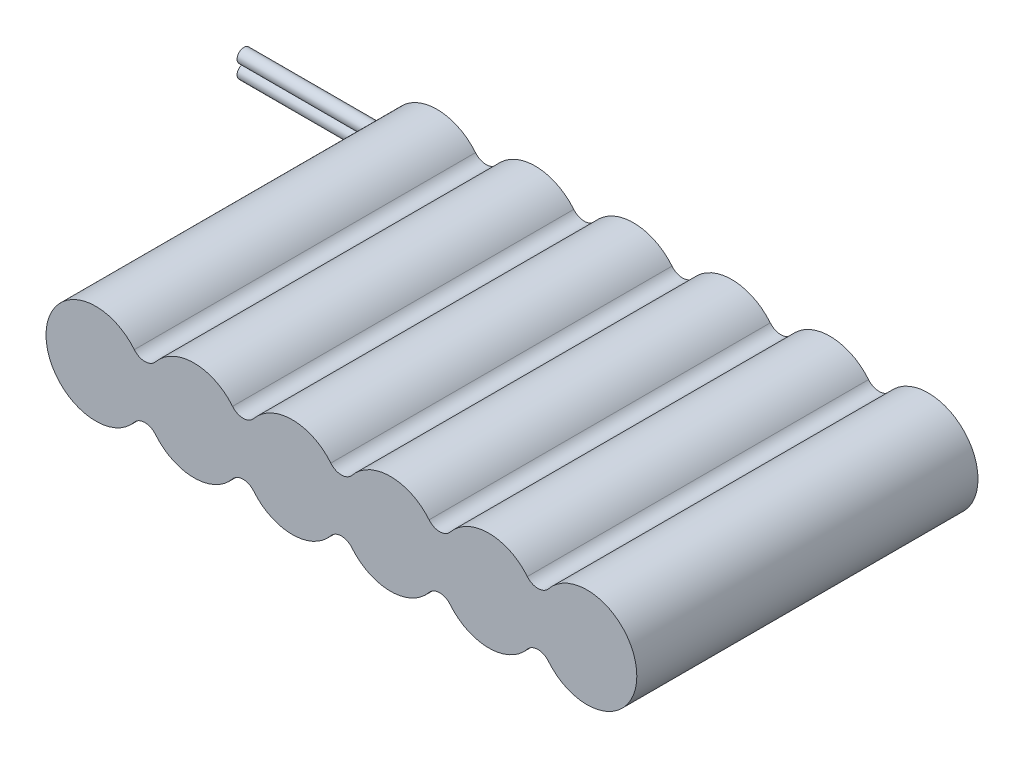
ISO-10303-21;
HEADER;
FILE_DESCRIPTION(('STEP AP214'),'2;1');
FILE_NAME('part.step','',(''),(''),'','','');
FILE_SCHEMA(('AUTOMOTIVE_DESIGN { 1 0 10303 214 1 1 1 1 }'));
ENDSEC;
DATA;
#1=APPLICATION_CONTEXT('core data for automotive mechanical design processes');
#2=APPLICATION_PROTOCOL_DEFINITION('international standard','automotive_design',2000,#1);
#3=PRODUCT_CONTEXT('',#1,'mechanical');
#4=PRODUCT('Part','Part','',(#3));
#5=PRODUCT_RELATED_PRODUCT_CATEGORY('part','',(#4));
#6=PRODUCT_DEFINITION_FORMATION('','',#4);
#7=PRODUCT_DEFINITION_CONTEXT('part definition',#1,'design');
#8=PRODUCT_DEFINITION('design','',#6,#7);
#9=PRODUCT_DEFINITION_SHAPE('','',#8);
#10=(LENGTH_UNIT() NAMED_UNIT(*) SI_UNIT(.MILLI.,.METRE.));
#11=(NAMED_UNIT(*) PLANE_ANGLE_UNIT() SI_UNIT($,.RADIAN.));
#12=(NAMED_UNIT(*) SI_UNIT($,.STERADIAN.) SOLID_ANGLE_UNIT());
#13=UNCERTAINTY_MEASURE_WITH_UNIT(LENGTH_MEASURE(1.E-05),#10,'distance_accuracy_value','');
#14=(GEOMETRIC_REPRESENTATION_CONTEXT(3) GLOBAL_UNCERTAINTY_ASSIGNED_CONTEXT((#13)) GLOBAL_UNIT_ASSIGNED_CONTEXT((#10,
#11,#12)) REPRESENTATION_CONTEXT('',''));
#15=CARTESIAN_POINT('',(0.,0.,0.));
#16=DIRECTION('',(0.,0.,1.));
#17=DIRECTION('',(1.,0.,0.));
#18=AXIS2_PLACEMENT_3D('',#15,#16,#17);
#19=CARTESIAN_POINT('',(-34.6604166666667,-1.27,1.27));
#20=DIRECTION('',(1.,0.,0.));
#21=DIRECTION('',(0.,0.,-1.));
#22=AXIS2_PLACEMENT_3D('',#19,#20,#21);
#23=CYLINDRICAL_SURFACE('',#22,1.27);
#24=CARTESIAN_POINT('',(-9.26041666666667,-1.27,1.27));
#25=DIRECTION('',(-1.,0.,0.));
#26=DIRECTION('',(0.,0.,1.));
#27=AXIS2_PLACEMENT_3D('',#24,#25,#26);
#28=CIRCLE('',#27,1.27);
#29=CARTESIAN_POINT('',(-9.26041666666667,-0.00884622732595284,1.1203632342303));
#30=VERTEX_POINT('',#29);
#31=CARTESIAN_POINT('',(-9.26041666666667,-0.00884622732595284,1.41963676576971));
#32=VERTEX_POINT('',#31);
#33=EDGE_CURVE('E139',#30,#32,#28,.T.);
#34=ORIENTED_EDGE('',*,*,#33,.T.);
#35=DIRECTION('',(1.,0.,0.));
#36=VECTOR('',#35,1.);
#37=CARTESIAN_POINT('',(-34.6604166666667,-0.00884622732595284,1.41963676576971));
#38=LINE('',#37,#36);
#39=CARTESIAN_POINT('',(-34.6604166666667,-0.00884622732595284,1.41963676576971));
#40=VERTEX_POINT('',#39);
#41=EDGE_CURVE('E13',#40,#32,#38,.T.);
#42=ORIENTED_EDGE('',*,*,#41,.F.);
#43=CARTESIAN_POINT('',(-34.6604166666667,-1.27,1.27));
#44=DIRECTION('',(-1.,0.,0.));
#45=DIRECTION('',(0.,0.,1.));
#46=AXIS2_PLACEMENT_3D('',#43,#44,#45);
#47=CIRCLE('',#46,1.27);
#48=CARTESIAN_POINT('',(-34.6604166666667,-0.00884622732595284,1.1203632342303));
#49=VERTEX_POINT('',#48);
#50=EDGE_CURVE('E127',#49,#40,#47,.T.);
#51=ORIENTED_EDGE('',*,*,#50,.F.);
#52=DIRECTION('',(1.,0.,0.));
#53=VECTOR('',#52,1.);
#54=CARTESIAN_POINT('',(-34.6604166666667,-0.00884622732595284,1.1203632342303));
#55=LINE('',#54,#53);
#56=EDGE_CURVE('E135',#49,#30,#55,.T.);
#57=ORIENTED_EDGE('',*,*,#56,.T.);
#58=EDGE_LOOP('',(#34,#42,#51,#57));
#59=FACE_BOUND('',#58,.T.);
#60=ADVANCED_FACE('F76',(#59),#23,.T.);
#61=CARTESIAN_POINT('',(-34.6604166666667,0.00884622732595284,1.41963676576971));
#62=DIRECTION('',(0.,0.,-1.));
#63=DIRECTION('',(-1.,0.,0.));
#64=AXIS2_PLACEMENT_3D('',#61,#62,#63);
#65=PLANE('',#64);
#66=DIRECTION('',(0.,1.,0.));
#67=VECTOR('',#66,1.);
#68=CARTESIAN_POINT('',(-9.26041666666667,0.00884622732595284,1.41963676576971));
#69=LINE('',#68,#67);
#70=CARTESIAN_POINT('',(-9.26041666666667,0.00884622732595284,1.41963676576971));
#71=VERTEX_POINT('',#70);
#72=EDGE_CURVE('E131',#32,#71,#69,.T.);
#73=ORIENTED_EDGE('',*,*,#72,.T.);
#74=DIRECTION('',(1.,0.,0.));
#75=VECTOR('',#74,1.);
#76=CARTESIAN_POINT('',(-34.6604166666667,0.00884622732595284,1.41963676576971));
#77=LINE('',#76,#75);
#78=CARTESIAN_POINT('',(-34.6604166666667,0.00884622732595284,1.41963676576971));
#79=VERTEX_POINT('',#78);
#80=EDGE_CURVE('E84',#79,#71,#77,.T.);
#81=ORIENTED_EDGE('',*,*,#80,.F.);
#82=DIRECTION('',(0.,1.,0.));
#83=VECTOR('',#82,1.);
#84=CARTESIAN_POINT('',(-34.6604166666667,0.00884622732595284,1.41963676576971));
#85=LINE('',#84,#83);
#86=EDGE_CURVE('E122',#40,#79,#85,.T.);
#87=ORIENTED_EDGE('',*,*,#86,.F.);
#88=ORIENTED_EDGE('',*,*,#41,.T.);
#89=EDGE_LOOP('',(#73,#81,#87,#88));
#90=FACE_BOUND('',#89,.T.);
#91=ADVANCED_FACE('F130',(#90),#65,.F.);
#92=CARTESIAN_POINT('',(-34.6604166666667,1.27,1.27));
#93=DIRECTION('',(1.,0.,0.));
#94=DIRECTION('',(0.,0.,-1.));
#95=AXIS2_PLACEMENT_3D('',#92,#93,#94);
#96=CYLINDRICAL_SURFACE('',#95,1.27);
#97=CARTESIAN_POINT('',(-9.26041666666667,1.27,1.27));
#98=DIRECTION('',(-1.,0.,0.));
#99=DIRECTION('',(0.,0.,1.));
#100=AXIS2_PLACEMENT_3D('',#97,#98,#99);
#101=CIRCLE('',#100,1.27);
#102=CARTESIAN_POINT('',(-9.26041666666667,0.00884622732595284,1.12036323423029));
#103=VERTEX_POINT('',#102);
#104=EDGE_CURVE('E109',#71,#103,#101,.T.);
#105=ORIENTED_EDGE('',*,*,#104,.T.);
#106=DIRECTION('',(1.,0.,0.));
#107=VECTOR('',#106,1.);
#108=CARTESIAN_POINT('',(-34.6604166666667,0.00884622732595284,1.12036323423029));
#109=LINE('',#108,#107);
#110=CARTESIAN_POINT('',(-34.6604166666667,0.00884622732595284,1.12036323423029));
#111=VERTEX_POINT('',#110);
#112=EDGE_CURVE('E132',#111,#103,#109,.T.);
#113=ORIENTED_EDGE('',*,*,#112,.F.);
#114=CARTESIAN_POINT('',(-34.6604166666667,1.27,1.27));
#115=DIRECTION('',(-1.,0.,0.));
#116=DIRECTION('',(0.,0.,1.));
#117=AXIS2_PLACEMENT_3D('',#114,#115,#116);
#118=CIRCLE('',#117,1.27);
#119=EDGE_CURVE('E125',#79,#111,#118,.T.);
#120=ORIENTED_EDGE('',*,*,#119,.F.);
#121=ORIENTED_EDGE('',*,*,#80,.T.);
#122=EDGE_LOOP('',(#105,#113,#120,#121));
#123=FACE_BOUND('',#122,.T.);
#124=ADVANCED_FACE('F133',(#123),#96,.T.);
#125=CARTESIAN_POINT('',(-34.6604166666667,0.00884622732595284,1.1203632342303));
#126=DIRECTION('',(0.,0.,1.));
#127=DIRECTION('',(1.,0.,0.));
#128=AXIS2_PLACEMENT_3D('',#125,#126,#127);
#129=PLANE('',#128);
#130=DIRECTION('',(0.,-1.,0.));
#131=VECTOR('',#130,1.);
#132=CARTESIAN_POINT('',(-9.26041666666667,0.00884622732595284,1.1203632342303));
#133=LINE('',#132,#131);
#134=EDGE_CURVE('E115',#103,#30,#133,.T.);
#135=ORIENTED_EDGE('',*,*,#134,.T.);
#136=ORIENTED_EDGE('',*,*,#56,.F.);
#137=DIRECTION('',(0.,-1.,0.));
#138=VECTOR('',#137,1.);
#139=CARTESIAN_POINT('',(-34.6604166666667,0.00884622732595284,1.1203632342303));
#140=LINE('',#139,#138);
#141=EDGE_CURVE('E92',#111,#49,#140,.T.);
#142=ORIENTED_EDGE('',*,*,#141,.F.);
#143=ORIENTED_EDGE('',*,*,#112,.T.);
#144=EDGE_LOOP('',(#135,#136,#142,#143));
#145=FACE_BOUND('',#144,.T.);
#146=ADVANCED_FACE('F146',(#145),#129,.F.);
#147=CARTESIAN_POINT('',(-34.6604166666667,-1.27,1.27));
#148=DIRECTION('',(-1.,0.,0.));
#149=DIRECTION('',(0.,0.,1.));
#150=AXIS2_PLACEMENT_3D('',#147,#148,#149);
#151=PLANE('',#150);
#152=ORIENTED_EDGE('',*,*,#50,.T.);
#153=ORIENTED_EDGE('',*,*,#86,.T.);
#154=ORIENTED_EDGE('',*,*,#119,.T.);
#155=ORIENTED_EDGE('',*,*,#141,.T.);
#156=EDGE_LOOP('',(#152,#153,#154,#155));
#157=FACE_BOUND('',#156,.T.);
#158=ADVANCED_FACE('F123',(#157),#151,.T.);
#159=CARTESIAN_POINT('',(-9.26041666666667,-1.27,1.27));
#160=DIRECTION('',(-1.,0.,0.));
#161=DIRECTION('',(0.,0.,1.));
#162=AXIS2_PLACEMENT_3D('',#159,#160,#161);
#163=PLANE('',#162);
#164=ORIENTED_EDGE('',*,*,#33,.F.);
#165=ORIENTED_EDGE('',*,*,#134,.F.);
#166=ORIENTED_EDGE('',*,*,#104,.F.);
#167=ORIENTED_EDGE('',*,*,#72,.F.);
#168=EDGE_LOOP('',(#164,#165,#166,#167));
#169=FACE_BOUND('',#168,.T.);
#170=ADVANCED_FACE('F149',(#169),#163,.F.);
#171=CLOSED_SHELL('',(#60,#91,#124,#146,#158,#170));
#172=MANIFOLD_SOLID_BREP('B2',#171);
#173=CARTESIAN_POINT('',(91.44,0.,63.5));
#174=DIRECTION('',(0.,0.,-1.));
#175=DIRECTION('',(-1.,0.,0.));
#176=AXIS2_PLACEMENT_3D('',#173,#174,#175);
#177=CYLINDRICAL_SURFACE('',#176,9.26041666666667);
#178=CARTESIAN_POINT('',(91.44,0.,63.5));
#179=DIRECTION('',(0.,0.,1.));
#180=DIRECTION('',(1.,0.,0.));
#181=AXIS2_PLACEMENT_3D('',#178,#179,#180);
#182=CIRCLE('',#181,9.26041666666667);
#183=CARTESIAN_POINT('',(84.2642152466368,-5.85349724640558,63.5));
#184=VERTEX_POINT('',#183);
#185=CARTESIAN_POINT('',(84.2642152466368,5.85349724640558,63.5));
#186=VERTEX_POINT('',#185);
#187=EDGE_CURVE('E350',#184,#186,#182,.T.);
#188=ORIENTED_EDGE('',*,*,#187,.F.);
#189=DIRECTION('',(0.,0.,-1.));
#190=VECTOR('',#189,1.);
#191=CARTESIAN_POINT('',(84.2642152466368,-5.85349724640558,63.5));
#192=LINE('',#191,#190);
#193=CARTESIAN_POINT('',(84.2642152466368,-5.85349724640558,0.));
#194=VERTEX_POINT('',#193);
#195=EDGE_CURVE('E404',#184,#194,#192,.T.);
#196=ORIENTED_EDGE('',*,*,#195,.T.);
#197=CARTESIAN_POINT('',(91.44,0.,0.));
#198=DIRECTION('',(0.,0.,1.));
#199=DIRECTION('',(1.,0.,0.));
#200=AXIS2_PLACEMENT_3D('',#197,#198,#199);
#201=CIRCLE('',#200,9.26041666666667);
#202=CARTESIAN_POINT('',(84.2642152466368,5.85349724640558,0.));
#203=VERTEX_POINT('',#202);
#204=EDGE_CURVE('E398',#194,#203,#201,.T.);
#205=ORIENTED_EDGE('',*,*,#204,.T.);
#206=DIRECTION('',(0.,0.,-1.));
#207=VECTOR('',#206,1.);
#208=CARTESIAN_POINT('',(84.2642152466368,5.85349724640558,63.5));
#209=LINE('',#208,#207);
#210=EDGE_CURVE('E401',#203,#186,#209,.F.);
#211=ORIENTED_EDGE('',*,*,#210,.T.);
#212=EDGE_LOOP('',(#188,#196,#205,#211));
#213=FACE_BOUND('',#212,.T.);
#214=ADVANCED_FACE('F201',(#213),#177,.T.);
#215=CARTESIAN_POINT('',(91.44,0.,0.));
#216=DIRECTION('',(0.,0.,1.));
#217=DIRECTION('',(1.,0.,0.));
#218=AXIS2_PLACEMENT_3D('',#215,#216,#217);
#219=PLANE('',#218);
#220=ORIENTED_EDGE('',*,*,#204,.F.);
#221=CARTESIAN_POINT('',(82.296,-7.45902791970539,0.));
#222=DIRECTION('',(0.,0.,1.));
#223=DIRECTION('',(1.,0.,0.));
#224=AXIS2_PLACEMENT_3D('',#221,#222,#223);
#225=CIRCLE('',#224,2.54);
#226=CARTESIAN_POINT('',(80.3277847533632,-5.85349724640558,0.));
#227=VERTEX_POINT('',#226);
#228=EDGE_CURVE('E358',#194,#227,#225,.T.);
#229=ORIENTED_EDGE('',*,*,#228,.T.);
#230=CARTESIAN_POINT('',(73.152,0.,0.));
#231=DIRECTION('',(0.,0.,1.));
#232=DIRECTION('',(1.,0.,0.));
#233=AXIS2_PLACEMENT_3D('',#230,#231,#232);
#234=CIRCLE('',#233,9.26041666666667);
#235=CARTESIAN_POINT('',(65.9762152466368,-5.85349724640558,0.));
#236=VERTEX_POINT('',#235);
#237=EDGE_CURVE('E343',#236,#227,#234,.T.);
#238=ORIENTED_EDGE('',*,*,#237,.F.);
#239=CARTESIAN_POINT('',(64.008,-7.45902791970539,0.));
#240=DIRECTION('',(0.,0.,1.));
#241=DIRECTION('',(1.,0.,0.));
#242=AXIS2_PLACEMENT_3D('',#239,#240,#241);
#243=CIRCLE('',#242,2.54);
#244=CARTESIAN_POINT('',(62.0397847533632,-5.85349724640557,0.));
#245=VERTEX_POINT('',#244);
#246=EDGE_CURVE('E355',#236,#245,#243,.T.);
#247=ORIENTED_EDGE('',*,*,#246,.T.);
#248=CARTESIAN_POINT('',(54.864,0.,0.));
#249=DIRECTION('',(0.,0.,1.));
#250=DIRECTION('',(1.,0.,0.));
#251=AXIS2_PLACEMENT_3D('',#248,#249,#250);
#252=CIRCLE('',#251,9.26041666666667);
#253=CARTESIAN_POINT('',(47.6882152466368,-5.85349724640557,0.));
#254=VERTEX_POINT('',#253);
#255=EDGE_CURVE('E523',#254,#245,#252,.T.);
#256=ORIENTED_EDGE('',*,*,#255,.F.);
#257=CARTESIAN_POINT('',(45.72,-7.45902791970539,0.));
#258=DIRECTION('',(0.,0.,1.));
#259=DIRECTION('',(1.,0.,0.));
#260=AXIS2_PLACEMENT_3D('',#257,#258,#259);
#261=CIRCLE('',#260,2.54);
#262=CARTESIAN_POINT('',(43.7517847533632,-5.85349724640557,0.));
#263=VERTEX_POINT('',#262);
#264=EDGE_CURVE('E369',#254,#263,#261,.T.);
#265=ORIENTED_EDGE('',*,*,#264,.T.);
#266=CARTESIAN_POINT('',(36.576,0.,0.));
#267=DIRECTION('',(0.,0.,1.));
#268=DIRECTION('',(1.,0.,0.));
#269=AXIS2_PLACEMENT_3D('',#266,#267,#268);
#270=CIRCLE('',#269,9.26041666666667);
#271=CARTESIAN_POINT('',(29.4002152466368,-5.85349724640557,0.));
#272=VERTEX_POINT('',#271);
#273=EDGE_CURVE('E503',#272,#263,#270,.T.);
#274=ORIENTED_EDGE('',*,*,#273,.F.);
#275=CARTESIAN_POINT('',(27.432,-7.45902791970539,0.));
#276=DIRECTION('',(0.,0.,1.));
#277=DIRECTION('',(1.,0.,0.));
#278=AXIS2_PLACEMENT_3D('',#275,#276,#277);
#279=CIRCLE('',#278,2.54);
#280=CARTESIAN_POINT('',(25.4637847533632,-5.85349724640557,0.));
#281=VERTEX_POINT('',#280);
#282=EDGE_CURVE('E377',#272,#281,#279,.T.);
#283=ORIENTED_EDGE('',*,*,#282,.T.);
#284=CARTESIAN_POINT('',(18.288,0.,0.));
#285=DIRECTION('',(0.,0.,1.));
#286=DIRECTION('',(1.,0.,0.));
#287=AXIS2_PLACEMENT_3D('',#284,#285,#286);
#288=CIRCLE('',#287,9.26041666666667);
#289=CARTESIAN_POINT('',(11.1122152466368,-5.85349724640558,0.));
#290=VERTEX_POINT('',#289);
#291=EDGE_CURVE('E536',#290,#281,#288,.T.);
#292=ORIENTED_EDGE('',*,*,#291,.F.);
#293=CARTESIAN_POINT('',(9.144,-7.45902791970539,0.));
#294=DIRECTION('',(0.,0.,1.));
#295=DIRECTION('',(1.,0.,0.));
#296=AXIS2_PLACEMENT_3D('',#293,#294,#295);
#297=CIRCLE('',#296,2.54);
#298=CARTESIAN_POINT('',(7.17578475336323,-5.85349724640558,0.));
#299=VERTEX_POINT('',#298);
#300=EDGE_CURVE('E381',#290,#299,#297,.T.);
#301=ORIENTED_EDGE('',*,*,#300,.T.);
#302=CARTESIAN_POINT('',(0.,0.,0.));
#303=DIRECTION('',(0.,0.,1.));
#304=DIRECTION('',(1.,0.,0.));
#305=AXIS2_PLACEMENT_3D('',#302,#303,#304);
#306=CIRCLE('',#305,9.26041666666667);
#307=CARTESIAN_POINT('',(7.17578475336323,5.85349724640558,0.));
#308=VERTEX_POINT('',#307);
#309=EDGE_CURVE('E542',#308,#299,#306,.T.);
#310=ORIENTED_EDGE('',*,*,#309,.F.);
#311=CARTESIAN_POINT('',(9.144,7.45902791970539,0.));
#312=DIRECTION('',(0.,0.,1.));
#313=DIRECTION('',(1.,0.,0.));
#314=AXIS2_PLACEMENT_3D('',#311,#312,#313);
#315=CIRCLE('',#314,2.54);
#316=CARTESIAN_POINT('',(11.1122152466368,5.85349724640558,0.));
#317=VERTEX_POINT('',#316);
#318=EDGE_CURVE('E383',#308,#317,#315,.T.);
#319=ORIENTED_EDGE('',*,*,#318,.T.);
#320=CARTESIAN_POINT('',(25.4637847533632,5.85349724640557,0.));
#321=VERTEX_POINT('',#320);
#322=EDGE_CURVE('E537',#321,#317,#288,.T.);
#323=ORIENTED_EDGE('',*,*,#322,.F.);
#324=CARTESIAN_POINT('',(27.432,7.45902791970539,0.));
#325=DIRECTION('',(0.,0.,1.));
#326=DIRECTION('',(1.,0.,0.));
#327=AXIS2_PLACEMENT_3D('',#324,#325,#326);
#328=CIRCLE('',#327,2.54);
#329=CARTESIAN_POINT('',(29.4002152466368,5.85349724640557,0.));
#330=VERTEX_POINT('',#329);
#331=EDGE_CURVE('E387',#321,#330,#328,.T.);
#332=ORIENTED_EDGE('',*,*,#331,.T.);
#333=CARTESIAN_POINT('',(43.7517847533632,5.85349724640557,0.));
#334=VERTEX_POINT('',#333);
#335=EDGE_CURVE('E510',#334,#330,#270,.T.);
#336=ORIENTED_EDGE('',*,*,#335,.F.);
#337=CARTESIAN_POINT('',(45.72,7.45902791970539,0.));
#338=DIRECTION('',(0.,0.,1.));
#339=DIRECTION('',(1.,0.,0.));
#340=AXIS2_PLACEMENT_3D('',#337,#338,#339);
#341=CIRCLE('',#340,2.54);
#342=CARTESIAN_POINT('',(47.6882152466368,5.85349724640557,0.));
#343=VERTEX_POINT('',#342);
#344=EDGE_CURVE('E391',#334,#343,#341,.T.);
#345=ORIENTED_EDGE('',*,*,#344,.T.);
#346=CARTESIAN_POINT('',(62.0397847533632,5.85349724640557,0.));
#347=VERTEX_POINT('',#346);
#348=EDGE_CURVE('E526',#347,#343,#252,.T.);
#349=ORIENTED_EDGE('',*,*,#348,.F.);
#350=CARTESIAN_POINT('',(64.008,7.45902791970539,0.));
#351=DIRECTION('',(0.,0.,1.));
#352=DIRECTION('',(1.,0.,0.));
#353=AXIS2_PLACEMENT_3D('',#350,#351,#352);
#354=CIRCLE('',#353,2.54);
#355=CARTESIAN_POINT('',(65.9762152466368,5.85349724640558,0.));
#356=VERTEX_POINT('',#355);
#357=EDGE_CURVE('E216',#347,#356,#354,.T.);
#358=ORIENTED_EDGE('',*,*,#357,.T.);
#359=CARTESIAN_POINT('',(80.3277847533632,5.85349724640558,0.));
#360=VERTEX_POINT('',#359);
#361=EDGE_CURVE('E360',#360,#356,#234,.T.);
#362=ORIENTED_EDGE('',*,*,#361,.F.);
#363=CARTESIAN_POINT('',(82.296,7.45902791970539,0.));
#364=DIRECTION('',(0.,0.,1.));
#365=DIRECTION('',(1.,0.,0.));
#366=AXIS2_PLACEMENT_3D('',#363,#364,#365);
#367=CIRCLE('',#366,2.54);
#368=EDGE_CURVE('E209',#360,#203,#367,.T.);
#369=ORIENTED_EDGE('',*,*,#368,.T.);
#370=EDGE_LOOP('',(#220,#229,#238,#247,#256,#265,#274,#283,#292,#301,#310,#319,#323,#332,#336,
#345,#349,#358,#362,#369));
#371=FACE_BOUND('',#370,.T.);
#372=ADVANCED_FACE('F353',(#371),#219,.F.);
#373=CARTESIAN_POINT('',(91.44,0.,63.5));
#374=DIRECTION('',(0.,0.,1.));
#375=DIRECTION('',(1.,0.,0.));
#376=AXIS2_PLACEMENT_3D('',#373,#374,#375);
#377=PLANE('',#376);
#378=CARTESIAN_POINT('',(73.152,0.,63.5));
#379=DIRECTION('',(0.,0.,1.));
#380=DIRECTION('',(1.,0.,0.));
#381=AXIS2_PLACEMENT_3D('',#378,#379,#380);
#382=CIRCLE('',#381,9.26041666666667);
#383=CARTESIAN_POINT('',(65.9762152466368,-5.85349724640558,63.5));
#384=VERTEX_POINT('',#383);
#385=CARTESIAN_POINT('',(80.3277847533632,-5.85349724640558,63.5));
#386=VERTEX_POINT('',#385);
#387=EDGE_CURVE('E346',#384,#386,#382,.T.);
#388=ORIENTED_EDGE('',*,*,#387,.T.);
#389=CARTESIAN_POINT('',(82.296,-7.45902791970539,63.5));
#390=DIRECTION('',(0.,0.,1.));
#391=DIRECTION('',(1.,0.,0.));
#392=AXIS2_PLACEMENT_3D('',#389,#390,#391);
#393=CIRCLE('',#392,2.54);
#394=EDGE_CURVE('E449',#386,#184,#393,.F.);
#395=ORIENTED_EDGE('',*,*,#394,.T.);
#396=ORIENTED_EDGE('',*,*,#187,.T.);
#397=CARTESIAN_POINT('',(82.296,7.45902791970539,63.5));
#398=DIRECTION('',(0.,0.,1.));
#399=DIRECTION('',(1.,0.,0.));
#400=AXIS2_PLACEMENT_3D('',#397,#398,#399);
#401=CIRCLE('',#400,2.54);
#402=CARTESIAN_POINT('',(80.3277847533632,5.85349724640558,63.5));
#403=VERTEX_POINT('',#402);
#404=EDGE_CURVE('E74',#186,#403,#401,.F.);
#405=ORIENTED_EDGE('',*,*,#404,.T.);
#406=CARTESIAN_POINT('',(65.9762152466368,5.85349724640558,63.5));
#407=VERTEX_POINT('',#406);
#408=EDGE_CURVE('E359',#403,#407,#382,.T.);
#409=ORIENTED_EDGE('',*,*,#408,.T.);
#410=CARTESIAN_POINT('',(64.008,7.45902791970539,63.5));
#411=DIRECTION('',(0.,0.,1.));
#412=DIRECTION('',(1.,0.,0.));
#413=AXIS2_PLACEMENT_3D('',#410,#411,#412);
#414=CIRCLE('',#413,2.54);
#415=CARTESIAN_POINT('',(62.0397847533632,5.85349724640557,63.5));
#416=VERTEX_POINT('',#415);
#417=EDGE_CURVE('E396',#407,#416,#414,.F.);
#418=ORIENTED_EDGE('',*,*,#417,.T.);
#419=CARTESIAN_POINT('',(54.864,0.,63.5));
#420=DIRECTION('',(0.,0.,1.));
#421=DIRECTION('',(1.,0.,0.));
#422=AXIS2_PLACEMENT_3D('',#419,#420,#421);
#423=CIRCLE('',#422,9.26041666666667);
#424=CARTESIAN_POINT('',(47.6882152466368,5.85349724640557,63.5));
#425=VERTEX_POINT('',#424);
#426=EDGE_CURVE('E520',#416,#425,#423,.T.);
#427=ORIENTED_EDGE('',*,*,#426,.T.);
#428=CARTESIAN_POINT('',(45.72,7.45902791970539,63.5));
#429=DIRECTION('',(0.,0.,1.));
#430=DIRECTION('',(1.,0.,0.));
#431=AXIS2_PLACEMENT_3D('',#428,#429,#430);
#432=CIRCLE('',#431,2.54);
#433=CARTESIAN_POINT('',(43.7517847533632,5.85349724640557,63.5));
#434=VERTEX_POINT('',#433);
#435=EDGE_CURVE('E393',#425,#434,#432,.F.);
#436=ORIENTED_EDGE('',*,*,#435,.T.);
#437=CARTESIAN_POINT('',(36.576,0.,63.5));
#438=DIRECTION('',(0.,0.,1.));
#439=DIRECTION('',(1.,0.,0.));
#440=AXIS2_PLACEMENT_3D('',#437,#438,#439);
#441=CIRCLE('',#440,9.26041666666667);
#442=CARTESIAN_POINT('',(29.4002152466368,5.85349724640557,63.5));
#443=VERTEX_POINT('',#442);
#444=EDGE_CURVE('E509',#434,#443,#441,.T.);
#445=ORIENTED_EDGE('',*,*,#444,.T.);
#446=CARTESIAN_POINT('',(27.432,7.45902791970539,63.5));
#447=DIRECTION('',(0.,0.,1.));
#448=DIRECTION('',(1.,0.,0.));
#449=AXIS2_PLACEMENT_3D('',#446,#447,#448);
#450=CIRCLE('',#449,2.54);
#451=CARTESIAN_POINT('',(25.4637847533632,5.85349724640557,63.5));
#452=VERTEX_POINT('',#451);
#453=EDGE_CURVE('E389',#443,#452,#450,.F.);
#454=ORIENTED_EDGE('',*,*,#453,.T.);
#455=CARTESIAN_POINT('',(18.288,0.,63.5));
#456=DIRECTION('',(0.,0.,1.));
#457=DIRECTION('',(1.,0.,0.));
#458=AXIS2_PLACEMENT_3D('',#455,#456,#457);
#459=CIRCLE('',#458,9.26041666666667);
#460=CARTESIAN_POINT('',(11.1122152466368,5.85349724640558,63.5));
#461=VERTEX_POINT('',#460);
#462=EDGE_CURVE('E533',#452,#461,#459,.T.);
#463=ORIENTED_EDGE('',*,*,#462,.T.);
#464=CARTESIAN_POINT('',(9.144,7.45902791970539,63.5));
#465=DIRECTION('',(0.,0.,1.));
#466=DIRECTION('',(1.,0.,0.));
#467=AXIS2_PLACEMENT_3D('',#464,#465,#466);
#468=CIRCLE('',#467,2.54);
#469=CARTESIAN_POINT('',(7.17578475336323,5.85349724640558,63.5));
#470=VERTEX_POINT('',#469);
#471=EDGE_CURVE('E385',#461,#470,#468,.F.);
#472=ORIENTED_EDGE('',*,*,#471,.T.);
#473=CARTESIAN_POINT('',(0.,0.,63.5));
#474=DIRECTION('',(0.,0.,1.));
#475=DIRECTION('',(1.,0.,0.));
#476=AXIS2_PLACEMENT_3D('',#473,#474,#475);
#477=CIRCLE('',#476,9.26041666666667);
#478=CARTESIAN_POINT('',(7.17578475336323,-5.85349724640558,63.5));
#479=VERTEX_POINT('',#478);
#480=EDGE_CURVE('E539',#470,#479,#477,.T.);
#481=ORIENTED_EDGE('',*,*,#480,.T.);
#482=CARTESIAN_POINT('',(9.144,-7.45902791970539,63.5));
#483=DIRECTION('',(0.,0.,1.));
#484=DIRECTION('',(1.,0.,0.));
#485=AXIS2_PLACEMENT_3D('',#482,#483,#484);
#486=CIRCLE('',#485,2.54);
#487=CARTESIAN_POINT('',(11.1122152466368,-5.85349724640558,63.5));
#488=VERTEX_POINT('',#487);
#489=EDGE_CURVE('E379',#479,#488,#486,.F.);
#490=ORIENTED_EDGE('',*,*,#489,.T.);
#491=CARTESIAN_POINT('',(25.4637847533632,-5.85349724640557,63.5));
#492=VERTEX_POINT('',#491);
#493=EDGE_CURVE('E532',#488,#492,#459,.T.);
#494=ORIENTED_EDGE('',*,*,#493,.T.);
#495=CARTESIAN_POINT('',(27.432,-7.45902791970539,63.5));
#496=DIRECTION('',(0.,0.,1.));
#497=DIRECTION('',(1.,0.,0.));
#498=AXIS2_PLACEMENT_3D('',#495,#496,#497);
#499=CIRCLE('',#498,2.54);
#500=CARTESIAN_POINT('',(29.4002152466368,-5.85349724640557,63.5));
#501=VERTEX_POINT('',#500);
#502=EDGE_CURVE('E375',#492,#501,#499,.F.);
#503=ORIENTED_EDGE('',*,*,#502,.T.);
#504=CARTESIAN_POINT('',(43.7517847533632,-5.85349724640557,63.5));
#505=VERTEX_POINT('',#504);
#506=EDGE_CURVE('E518',#501,#505,#441,.T.);
#507=ORIENTED_EDGE('',*,*,#506,.T.);
#508=CARTESIAN_POINT('',(45.72,-7.45902791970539,63.5));
#509=DIRECTION('',(0.,0.,1.));
#510=DIRECTION('',(1.,0.,0.));
#511=AXIS2_PLACEMENT_3D('',#508,#509,#510);
#512=CIRCLE('',#511,2.54);
#513=CARTESIAN_POINT('',(47.6882152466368,-5.85349724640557,63.5));
#514=VERTEX_POINT('',#513);
#515=EDGE_CURVE('E366',#505,#514,#512,.F.);
#516=ORIENTED_EDGE('',*,*,#515,.T.);
#517=CARTESIAN_POINT('',(62.0397847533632,-5.85349724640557,63.5));
#518=VERTEX_POINT('',#517);
#519=EDGE_CURVE('E517',#514,#518,#423,.T.);
#520=ORIENTED_EDGE('',*,*,#519,.T.);
#521=CARTESIAN_POINT('',(64.008,-7.45902791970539,63.5));
#522=DIRECTION('',(0.,0.,1.));
#523=DIRECTION('',(1.,0.,0.));
#524=AXIS2_PLACEMENT_3D('',#521,#522,#523);
#525=CIRCLE('',#524,2.54);
#526=EDGE_CURVE('E367',#518,#384,#525,.F.);
#527=ORIENTED_EDGE('',*,*,#526,.T.);
#528=EDGE_LOOP('',(#388,#395,#396,#405,#409,#418,#427,#436,#445,#454,#463,#472,#481,#490,#494,
#503,#507,#516,#520,#527));
#529=FACE_BOUND('',#528,.T.);
#530=ADVANCED_FACE('F451',(#529),#377,.T.);
#531=CARTESIAN_POINT('',(0.,0.,63.5));
#532=DIRECTION('',(0.,0.,-1.));
#533=DIRECTION('',(-1.,0.,0.));
#534=AXIS2_PLACEMENT_3D('',#531,#532,#533);
#535=CYLINDRICAL_SURFACE('',#534,9.26041666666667);
#536=ORIENTED_EDGE('',*,*,#309,.T.);
#537=DIRECTION('',(0.,0.,-1.));
#538=VECTOR('',#537,1.);
#539=CARTESIAN_POINT('',(7.17578475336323,-5.85349724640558,63.5));
#540=LINE('',#539,#538);
#541=EDGE_CURVE('E427',#299,#479,#540,.F.);
#542=ORIENTED_EDGE('',*,*,#541,.T.);
#543=ORIENTED_EDGE('',*,*,#480,.F.);
#544=DIRECTION('',(0.,0.,-1.));
#545=VECTOR('',#544,1.);
#546=CARTESIAN_POINT('',(7.17578475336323,5.85349724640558,63.5));
#547=LINE('',#546,#545);
#548=EDGE_CURVE('E424',#470,#308,#547,.T.);
#549=ORIENTED_EDGE('',*,*,#548,.T.);
#550=EDGE_LOOP('',(#536,#542,#543,#549));
#551=FACE_BOUND('',#550,.T.);
#552=ADVANCED_FACE('F458',(#551),#535,.T.);
#553=CARTESIAN_POINT('',(18.288,0.,63.5));
#554=DIRECTION('',(0.,0.,-1.));
#555=DIRECTION('',(-1.,0.,0.));
#556=AXIS2_PLACEMENT_3D('',#553,#554,#555);
#557=CYLINDRICAL_SURFACE('',#556,9.26041666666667);
#558=ORIENTED_EDGE('',*,*,#322,.T.);
#559=DIRECTION('',(0.,0.,-1.));
#560=VECTOR('',#559,1.);
#561=CARTESIAN_POINT('',(11.1122152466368,5.85349724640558,63.5));
#562=LINE('',#561,#560);
#563=EDGE_CURVE('E433',#317,#461,#562,.F.);
#564=ORIENTED_EDGE('',*,*,#563,.T.);
#565=ORIENTED_EDGE('',*,*,#462,.F.);
#566=DIRECTION('',(0.,0.,-1.));
#567=VECTOR('',#566,1.);
#568=CARTESIAN_POINT('',(25.4637847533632,5.85349724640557,63.5));
#569=LINE('',#568,#567);
#570=EDGE_CURVE('E430',#452,#321,#569,.T.);
#571=ORIENTED_EDGE('',*,*,#570,.T.);
#572=EDGE_LOOP('',(#558,#564,#565,#571));
#573=FACE_BOUND('',#572,.T.);
#574=ADVANCED_FACE('F469',(#573),#557,.T.);
#575=ORIENTED_EDGE('',*,*,#291,.T.);
#576=DIRECTION('',(0.,0.,-1.));
#577=VECTOR('',#576,1.);
#578=CARTESIAN_POINT('',(25.4637847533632,-5.85349724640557,63.5));
#579=LINE('',#578,#577);
#580=EDGE_CURVE('E421',#281,#492,#579,.F.);
#581=ORIENTED_EDGE('',*,*,#580,.T.);
#582=ORIENTED_EDGE('',*,*,#493,.F.);
#583=DIRECTION('',(0.,0.,-1.));
#584=VECTOR('',#583,1.);
#585=CARTESIAN_POINT('',(11.1122152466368,-5.85349724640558,63.5));
#586=LINE('',#585,#584);
#587=EDGE_CURVE('E419',#488,#290,#586,.T.);
#588=ORIENTED_EDGE('',*,*,#587,.T.);
#589=EDGE_LOOP('',(#575,#581,#582,#588));
#590=FACE_BOUND('',#589,.T.);
#591=ADVANCED_FACE('F471',(#590),#557,.T.);
#592=CARTESIAN_POINT('',(36.576,0.,63.5));
#593=DIRECTION('',(0.,0.,-1.));
#594=DIRECTION('',(-1.,0.,0.));
#595=AXIS2_PLACEMENT_3D('',#592,#593,#594);
#596=CYLINDRICAL_SURFACE('',#595,9.26041666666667);
#597=ORIENTED_EDGE('',*,*,#335,.T.);
#598=DIRECTION('',(0.,0.,-1.));
#599=VECTOR('',#598,1.);
#600=CARTESIAN_POINT('',(29.4002152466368,5.85349724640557,63.5));
#601=LINE('',#600,#599);
#602=EDGE_CURVE('E438',#330,#443,#601,.F.);
#603=ORIENTED_EDGE('',*,*,#602,.T.);
#604=ORIENTED_EDGE('',*,*,#444,.F.);
#605=DIRECTION('',(0.,0.,-1.));
#606=VECTOR('',#605,1.);
#607=CARTESIAN_POINT('',(43.7517847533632,5.85349724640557,63.5));
#608=LINE('',#607,#606);
#609=EDGE_CURVE('E435',#434,#334,#608,.T.);
#610=ORIENTED_EDGE('',*,*,#609,.T.);
#611=EDGE_LOOP('',(#597,#603,#604,#610));
#612=FACE_BOUND('',#611,.T.);
#613=ADVANCED_FACE('F486',(#612),#596,.T.);
#614=ORIENTED_EDGE('',*,*,#273,.T.);
#615=DIRECTION('',(0.,0.,-1.));
#616=VECTOR('',#615,1.);
#617=CARTESIAN_POINT('',(43.7517847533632,-5.85349724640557,63.5));
#618=LINE('',#617,#616);
#619=EDGE_CURVE('E416',#263,#505,#618,.F.);
#620=ORIENTED_EDGE('',*,*,#619,.T.);
#621=ORIENTED_EDGE('',*,*,#506,.F.);
#622=DIRECTION('',(0.,0.,-1.));
#623=VECTOR('',#622,1.);
#624=CARTESIAN_POINT('',(29.4002152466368,-5.85349724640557,63.5));
#625=LINE('',#624,#623);
#626=EDGE_CURVE('E414',#501,#272,#625,.T.);
#627=ORIENTED_EDGE('',*,*,#626,.T.);
#628=EDGE_LOOP('',(#614,#620,#621,#627));
#629=FACE_BOUND('',#628,.T.);
#630=ADVANCED_FACE('F484',(#629),#596,.T.);
#631=CARTESIAN_POINT('',(54.864,0.,63.5));
#632=DIRECTION('',(0.,0.,-1.));
#633=DIRECTION('',(-1.,0.,0.));
#634=AXIS2_PLACEMENT_3D('',#631,#632,#633);
#635=CYLINDRICAL_SURFACE('',#634,9.26041666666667);
#636=ORIENTED_EDGE('',*,*,#348,.T.);
#637=DIRECTION('',(0.,0.,-1.));
#638=VECTOR('',#637,1.);
#639=CARTESIAN_POINT('',(47.6882152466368,5.85349724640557,63.5));
#640=LINE('',#639,#638);
#641=EDGE_CURVE('E443',#343,#425,#640,.F.);
#642=ORIENTED_EDGE('',*,*,#641,.T.);
#643=ORIENTED_EDGE('',*,*,#426,.F.);
#644=DIRECTION('',(0.,0.,-1.));
#645=VECTOR('',#644,1.);
#646=CARTESIAN_POINT('',(62.0397847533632,5.85349724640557,63.5));
#647=LINE('',#646,#645);
#648=EDGE_CURVE('E440',#416,#347,#647,.T.);
#649=ORIENTED_EDGE('',*,*,#648,.T.);
#650=EDGE_LOOP('',(#636,#642,#643,#649));
#651=FACE_BOUND('',#650,.T.);
#652=ADVANCED_FACE('F480',(#651),#635,.T.);
#653=ORIENTED_EDGE('',*,*,#255,.T.);
#654=DIRECTION('',(0.,0.,-1.));
#655=VECTOR('',#654,1.);
#656=CARTESIAN_POINT('',(62.0397847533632,-5.85349724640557,63.5));
#657=LINE('',#656,#655);
#658=EDGE_CURVE('E365',#245,#518,#657,.F.);
#659=ORIENTED_EDGE('',*,*,#658,.T.);
#660=ORIENTED_EDGE('',*,*,#519,.F.);
#661=DIRECTION('',(0.,0.,-1.));
#662=VECTOR('',#661,1.);
#663=CARTESIAN_POINT('',(47.6882152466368,-5.85349724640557,63.5));
#664=LINE('',#663,#662);
#665=EDGE_CURVE('E408',#514,#254,#664,.T.);
#666=ORIENTED_EDGE('',*,*,#665,.T.);
#667=EDGE_LOOP('',(#653,#659,#660,#666));
#668=FACE_BOUND('',#667,.T.);
#669=ADVANCED_FACE('F483',(#668),#635,.T.);
#670=CARTESIAN_POINT('',(73.152,0.,63.5));
#671=DIRECTION('',(0.,0.,-1.));
#672=DIRECTION('',(-1.,0.,0.));
#673=AXIS2_PLACEMENT_3D('',#670,#671,#672);
#674=CYLINDRICAL_SURFACE('',#673,9.26041666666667);
#675=ORIENTED_EDGE('',*,*,#237,.T.);
#676=DIRECTION('',(0.,0.,-1.));
#677=VECTOR('',#676,1.);
#678=CARTESIAN_POINT('',(80.3277847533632,-5.85349724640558,63.5));
#679=LINE('',#678,#677);
#680=EDGE_CURVE('E349',#227,#386,#679,.F.);
#681=ORIENTED_EDGE('',*,*,#680,.T.);
#682=ORIENTED_EDGE('',*,*,#387,.F.);
#683=DIRECTION('',(0.,0.,-1.));
#684=VECTOR('',#683,1.);
#685=CARTESIAN_POINT('',(65.9762152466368,-5.85349724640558,63.5));
#686=LINE('',#685,#684);
#687=EDGE_CURVE('E339',#384,#236,#686,.T.);
#688=ORIENTED_EDGE('',*,*,#687,.T.);
#689=EDGE_LOOP('',(#675,#681,#682,#688));
#690=FACE_BOUND('',#689,.T.);
#691=ADVANCED_FACE('F341',(#690),#674,.T.);
#692=ORIENTED_EDGE('',*,*,#361,.T.);
#693=DIRECTION('',(0.,0.,-1.));
#694=VECTOR('',#693,1.);
#695=CARTESIAN_POINT('',(65.9762152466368,5.85349724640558,63.5));
#696=LINE('',#695,#694);
#697=EDGE_CURVE('E447',#356,#407,#696,.F.);
#698=ORIENTED_EDGE('',*,*,#697,.T.);
#699=ORIENTED_EDGE('',*,*,#408,.F.);
#700=DIRECTION('',(0.,0.,-1.));
#701=VECTOR('',#700,1.);
#702=CARTESIAN_POINT('',(80.3277847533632,5.85349724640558,63.5));
#703=LINE('',#702,#701);
#704=EDGE_CURVE('E445',#403,#360,#703,.T.);
#705=ORIENTED_EDGE('',*,*,#704,.T.);
#706=EDGE_LOOP('',(#692,#698,#699,#705));
#707=FACE_BOUND('',#706,.T.);
#708=ADVANCED_FACE('F456',(#707),#674,.T.);
#709=CARTESIAN_POINT('',(82.296,-7.45902791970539,63.5));
#710=DIRECTION('',(0.,0.,-1.));
#711=DIRECTION('',(-1.,0.,0.));
#712=AXIS2_PLACEMENT_3D('',#709,#710,#711);
#713=CYLINDRICAL_SURFACE('',#712,2.54);
#714=ORIENTED_EDGE('',*,*,#228,.F.);
#715=ORIENTED_EDGE('',*,*,#195,.F.);
#716=ORIENTED_EDGE('',*,*,#394,.F.);
#717=ORIENTED_EDGE('',*,*,#680,.F.);
#718=EDGE_LOOP('',(#714,#715,#716,#717));
#719=FACE_BOUND('',#718,.T.);
#720=ADVANCED_FACE('F454',(#719),#713,.F.);
#721=CARTESIAN_POINT('',(64.008,-7.45902791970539,63.5));
#722=DIRECTION('',(0.,0.,-1.));
#723=DIRECTION('',(-1.,0.,0.));
#724=AXIS2_PLACEMENT_3D('',#721,#722,#723);
#725=CYLINDRICAL_SURFACE('',#724,2.54);
#726=ORIENTED_EDGE('',*,*,#246,.F.);
#727=ORIENTED_EDGE('',*,*,#687,.F.);
#728=ORIENTED_EDGE('',*,*,#526,.F.);
#729=ORIENTED_EDGE('',*,*,#658,.F.);
#730=EDGE_LOOP('',(#726,#727,#728,#729));
#731=FACE_BOUND('',#730,.T.);
#732=ADVANCED_FACE('F363',(#731),#725,.F.);
#733=CARTESIAN_POINT('',(45.72,-7.45902791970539,63.5));
#734=DIRECTION('',(0.,0.,-1.));
#735=DIRECTION('',(-1.,0.,0.));
#736=AXIS2_PLACEMENT_3D('',#733,#734,#735);
#737=CYLINDRICAL_SURFACE('',#736,2.54);
#738=ORIENTED_EDGE('',*,*,#264,.F.);
#739=ORIENTED_EDGE('',*,*,#665,.F.);
#740=ORIENTED_EDGE('',*,*,#515,.F.);
#741=ORIENTED_EDGE('',*,*,#619,.F.);
#742=EDGE_LOOP('',(#738,#739,#740,#741));
#743=FACE_BOUND('',#742,.T.);
#744=ADVANCED_FACE('F463',(#743),#737,.F.);
#745=CARTESIAN_POINT('',(27.432,-7.45902791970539,63.5));
#746=DIRECTION('',(0.,0.,-1.));
#747=DIRECTION('',(-1.,0.,0.));
#748=AXIS2_PLACEMENT_3D('',#745,#746,#747);
#749=CYLINDRICAL_SURFACE('',#748,2.54);
#750=ORIENTED_EDGE('',*,*,#282,.F.);
#751=ORIENTED_EDGE('',*,*,#626,.F.);
#752=ORIENTED_EDGE('',*,*,#502,.F.);
#753=ORIENTED_EDGE('',*,*,#580,.F.);
#754=EDGE_LOOP('',(#750,#751,#752,#753));
#755=FACE_BOUND('',#754,.T.);
#756=ADVANCED_FACE('F558',(#755),#749,.F.);
#757=CARTESIAN_POINT('',(9.144,-7.45902791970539,63.5));
#758=DIRECTION('',(0.,0.,-1.));
#759=DIRECTION('',(-1.,0.,0.));
#760=AXIS2_PLACEMENT_3D('',#757,#758,#759);
#761=CYLINDRICAL_SURFACE('',#760,2.54);
#762=ORIENTED_EDGE('',*,*,#300,.F.);
#763=ORIENTED_EDGE('',*,*,#587,.F.);
#764=ORIENTED_EDGE('',*,*,#489,.F.);
#765=ORIENTED_EDGE('',*,*,#541,.F.);
#766=EDGE_LOOP('',(#762,#763,#764,#765));
#767=FACE_BOUND('',#766,.T.);
#768=ADVANCED_FACE('F550',(#767),#761,.F.);
#769=CARTESIAN_POINT('',(9.144,7.45902791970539,63.5));
#770=DIRECTION('',(0.,0.,1.));
#771=DIRECTION('',(1.,0.,0.));
#772=AXIS2_PLACEMENT_3D('',#769,#770,#771);
#773=CYLINDRICAL_SURFACE('',#772,2.54);
#774=ORIENTED_EDGE('',*,*,#471,.F.);
#775=ORIENTED_EDGE('',*,*,#563,.F.);
#776=ORIENTED_EDGE('',*,*,#318,.F.);
#777=ORIENTED_EDGE('',*,*,#548,.F.);
#778=EDGE_LOOP('',(#774,#775,#776,#777));
#779=FACE_BOUND('',#778,.T.);
#780=ADVANCED_FACE('F565',(#779),#773,.F.);
#781=CARTESIAN_POINT('',(27.432,7.45902791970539,63.5));
#782=DIRECTION('',(0.,0.,1.));
#783=DIRECTION('',(1.,0.,0.));
#784=AXIS2_PLACEMENT_3D('',#781,#782,#783);
#785=CYLINDRICAL_SURFACE('',#784,2.54);
#786=ORIENTED_EDGE('',*,*,#453,.F.);
#787=ORIENTED_EDGE('',*,*,#602,.F.);
#788=ORIENTED_EDGE('',*,*,#331,.F.);
#789=ORIENTED_EDGE('',*,*,#570,.F.);
#790=EDGE_LOOP('',(#786,#787,#788,#789));
#791=FACE_BOUND('',#790,.T.);
#792=ADVANCED_FACE('F571',(#791),#785,.F.);
#793=CARTESIAN_POINT('',(45.72,7.45902791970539,63.5));
#794=DIRECTION('',(0.,0.,1.));
#795=DIRECTION('',(1.,0.,0.));
#796=AXIS2_PLACEMENT_3D('',#793,#794,#795);
#797=CYLINDRICAL_SURFACE('',#796,2.54);
#798=ORIENTED_EDGE('',*,*,#435,.F.);
#799=ORIENTED_EDGE('',*,*,#641,.F.);
#800=ORIENTED_EDGE('',*,*,#344,.F.);
#801=ORIENTED_EDGE('',*,*,#609,.F.);
#802=EDGE_LOOP('',(#798,#799,#800,#801));
#803=FACE_BOUND('',#802,.T.);
#804=ADVANCED_FACE('F575',(#803),#797,.F.);
#805=CARTESIAN_POINT('',(64.008,7.45902791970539,63.5));
#806=DIRECTION('',(0.,0.,1.));
#807=DIRECTION('',(1.,0.,0.));
#808=AXIS2_PLACEMENT_3D('',#805,#806,#807);
#809=CYLINDRICAL_SURFACE('',#808,2.54);
#810=ORIENTED_EDGE('',*,*,#417,.F.);
#811=ORIENTED_EDGE('',*,*,#697,.F.);
#812=ORIENTED_EDGE('',*,*,#357,.F.);
#813=ORIENTED_EDGE('',*,*,#648,.F.);
#814=EDGE_LOOP('',(#810,#811,#812,#813));
#815=FACE_BOUND('',#814,.T.);
#816=ADVANCED_FACE('F578',(#815),#809,.F.);
#817=CARTESIAN_POINT('',(82.296,7.45902791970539,63.5));
#818=DIRECTION('',(0.,0.,1.));
#819=DIRECTION('',(1.,0.,0.));
#820=AXIS2_PLACEMENT_3D('',#817,#818,#819);
#821=CYLINDRICAL_SURFACE('',#820,2.54);
#822=ORIENTED_EDGE('',*,*,#404,.F.);
#823=ORIENTED_EDGE('',*,*,#210,.F.);
#824=ORIENTED_EDGE('',*,*,#368,.F.);
#825=ORIENTED_EDGE('',*,*,#704,.F.);
#826=EDGE_LOOP('',(#822,#823,#824,#825));
#827=FACE_BOUND('',#826,.T.);
#828=ADVANCED_FACE('F203',(#827),#821,.F.);
#829=CLOSED_SHELL('',(#214,#372,#530,#552,#574,#591,#613,#630,#652,#669,#691,#708,#720,#732,
#744,#756,#768,#780,#792,#804,#816,#828));
#830=MANIFOLD_SOLID_BREP('B7',#829);
#831=ADVANCED_BREP_SHAPE_REPRESENTATION('',(#18,#172,#830),#14);
#832=SHAPE_DEFINITION_REPRESENTATION(#9,#831);
ENDSEC;
END-ISO-10303-21;
